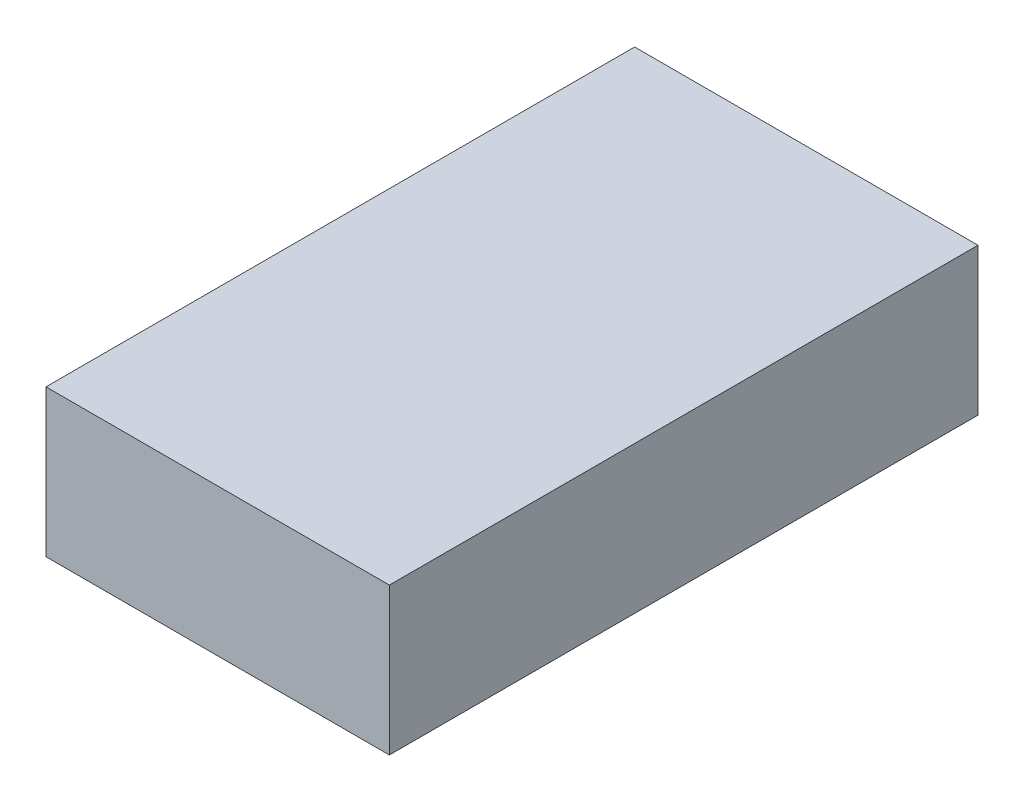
from build123d import *

# Parameters (mm, degrees)
SKETCH1_W           = 7
SKETCH1_H           = 12
BOSS_EXTRUDE1_DEPTH = 3


with BuildPart() as part:
    # Sketch1 → Boss-Extrude1 (new body)
    with BuildSketch(Plane(origin=(0, 0, 0), x_dir=(1, 0, 0), z_dir=(0, 1, 0))):
        with Locations((3.5, 6)):
            Rectangle(SKETCH1_W, SKETCH1_H)
    extrude(amount=BOSS_EXTRUDE1_DEPTH)


solid = part.part
